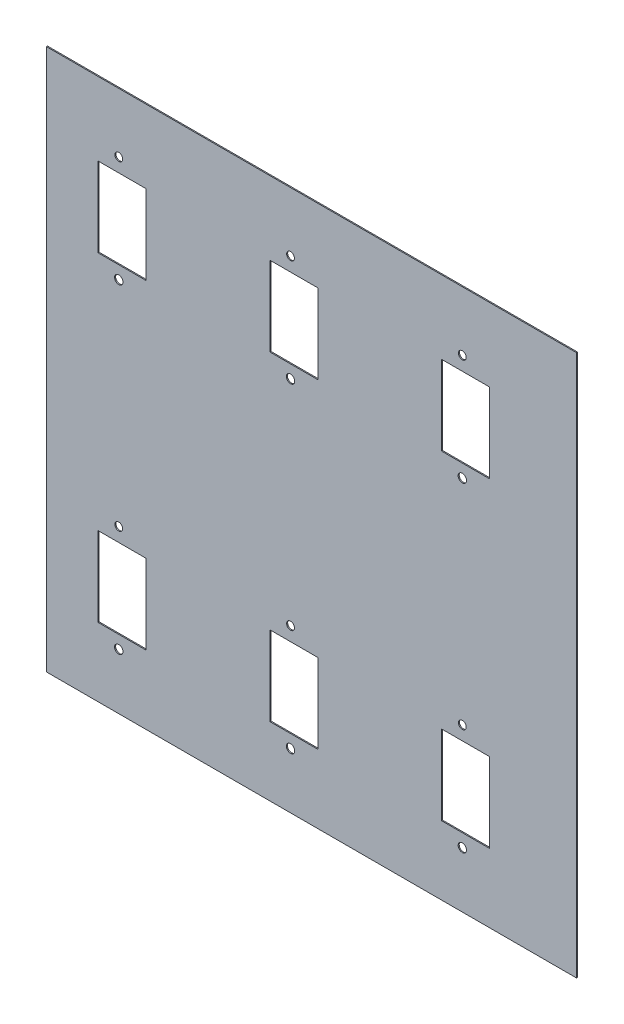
from build123d import *

# Parameters (mm, degrees)
SKETCH1_W            = 1261.969363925
SKETCH1_H            = 1289.192177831
EXTRUDE1_DEPTH       = 2.54
SKETCH2_W            = 114.426220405
SKETCH2_H            = 189.282777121
CUT_EXTRUDE1_DEPTH   = 1395.498273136
SKETCH3_R            = 9.334737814
SKETCH3_R_2          = 9.958839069
CUT_EXTRUDE2_DEPTH   = 1395.498273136
LPATTERN1_COUNT      = 2
LPATTERN1_PITCH      = 762
LPATTERN1_COUNT_DIR2 = 3
LPATTERN1_PITCH_DIR2 = 408.94


with BuildPart() as part:
    # Sketch1 → Extrude1 (new body)
    with BuildSketch(Plane.XY):
        with Locations((338.050068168, -358.195332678)):
            Rectangle(SKETCH1_W, SKETCH1_H)
    extrude(amount=EXTRUDE1_DEPTH)

    # Sketch2 → Cut-Extrude1 (cut, through all)
    with BuildSketch(Plane.XY.offset(2.54)):
        with Locations((-112.860629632, 17.455225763)):
            Rectangle(SKETCH2_W, SKETCH2_H)
    cut_extrude1 = extrude(amount=-CUT_EXTRUDE1_DEPTH, mode=Mode.SUBTRACT)

    # Sketch3 → Cut-Extrude2 (cut, through all)
    with BuildSketch(Plane.XY.offset(2.54)):
        with Locations((-120.68336915, 145.099046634)):
            Circle(SKETCH3_R)
        with Locations((-120.68336915, -108.095305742)):
            Circle(SKETCH3_R_2)
    cut_extrude2 = extrude(amount=-CUT_EXTRUDE2_DEPTH, mode=Mode.SUBTRACT)

    # LPattern1: Cut-Extrude1, Cut-Extrude2 2 × 3
    with Locations(*[(j * LPATTERN1_PITCH_DIR2, -i * LPATTERN1_PITCH, 0) for i in range(LPATTERN1_COUNT) for j in range(LPATTERN1_COUNT_DIR2) if (i, j) != (0, 0)]):
        add(cut_extrude1, mode=Mode.SUBTRACT)
        add(cut_extrude2, mode=Mode.SUBTRACT)


solid = part.part
